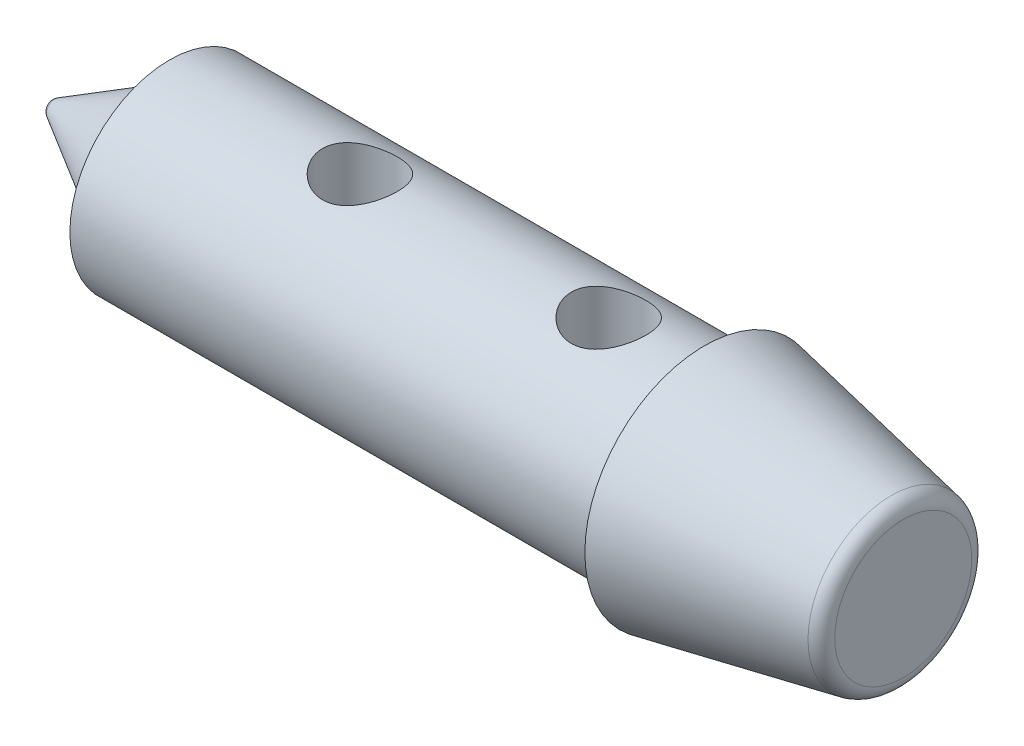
from build123d import *

# Parameters (mm, degrees)
ECHELLE1_SCALE                  = 1.25
DIAM_TRE_DU_PER_AGE_3_7_3_7_6_D = 3.75
CONG_1_R                        = 0.75
CONG_2_R                        = 0.2


with BuildPart() as part:
    # Esquisse1 → R_volution1 (revolve)
    with BuildSketch(Plane.XY):
        with BuildLine():
            Line((4.396152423, 4), (25.896152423, 4))
            Line((25.896152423, 4), (25.896152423, 4.8))
            Line((25.896152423, 4.8), (33.896152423, 3.25))
            Line((33.896152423, 3.25), (33.896152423, 0))
            Line((33.896152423, 0), (-0.4, 0))
            ThreePointArc((-0.4, 0), (-0.346410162, 0.2), (-0.2, 0.346410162))
            Line((-0.2, 0.346410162), (4.396152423, 3))
            Line((4.396152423, 3), (4.396152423, 4))
        make_face()
    revolve(axis=Axis((0, 0, 0), (1, 0, 0)))


with BuildPart() as part_1:
    # Echelle1: scaled about (18.571468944, 0, 0)
    add(part.part.scale(ECHELLE1_SCALE).moved(Location((-4.642867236, 0, 0))))

    # Diam_tre du per_age _3.7 _3.7_6 (through all)
    with Locations(Plane.XZ.offset(5)):
        with Locations((10.427323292, 0), (22.927323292, 0)):
            Hole(DIAM_TRE_DU_PER_AGE_3_7_3_7_6_D / 2)

    # Cong_1
    cong_1_edges = [part_1.edges().sort_by_distance(p)[0] for p in [
        (37.727323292, -4.0625, 0),
    ]]
    fillet(cong_1_edges, radius=CONG_1_R)

    # Cong_2
    cong_2_edges = [part_1.edges().sort_by_distance(p)[0] for p in [
        (27.727323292, -5, 0),
    ]]
    fillet(cong_2_edges, radius=CONG_2_R)


solid = part_1.part
